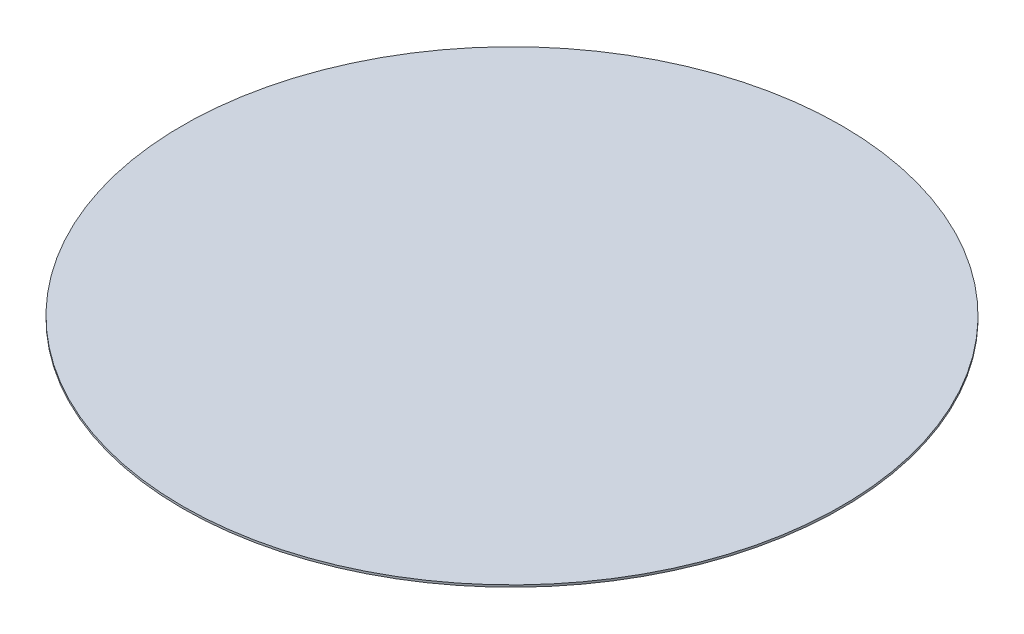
from build123d import *

# Parameters (mm, degrees)
ESQUISSE1_R        = 8
BOSS_EXTRU_1_DEPTH = 0.05


with BuildPart() as part:
    # Esquisse1 → Boss.-Extru.1 (new body)
    with BuildSketch(Plane(origin=(0, 0, 0), x_dir=(1, 0, 0), z_dir=(0, 1, 0))):
        with Locations(Location((0, 0, 0), (0, 0, 270))):
            Circle(ESQUISSE1_R)
    extrude(amount=BOSS_EXTRU_1_DEPTH)


solid = part.part
